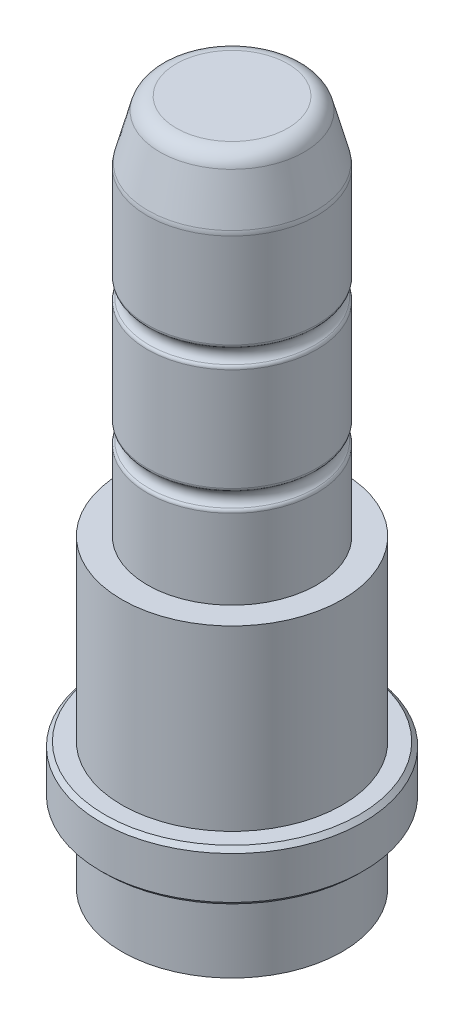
ISO-10303-21;
HEADER;
FILE_DESCRIPTION(('STEP AP214'),'2;1');
FILE_NAME('part.step','',(''),(''),'','','');
FILE_SCHEMA(('AUTOMOTIVE_DESIGN { 1 0 10303 214 1 1 1 1 }'));
ENDSEC;
DATA;
#1=APPLICATION_CONTEXT('core data for automotive mechanical design processes');
#2=APPLICATION_PROTOCOL_DEFINITION('international standard','automotive_design',2000,#1);
#3=PRODUCT_CONTEXT('',#1,'mechanical');
#4=PRODUCT('Part','Part','',(#3));
#5=PRODUCT_RELATED_PRODUCT_CATEGORY('part','',(#4));
#6=PRODUCT_DEFINITION_FORMATION('','',#4);
#7=PRODUCT_DEFINITION_CONTEXT('part definition',#1,'design');
#8=PRODUCT_DEFINITION('design','',#6,#7);
#9=PRODUCT_DEFINITION_SHAPE('','',#8);
#10=(LENGTH_UNIT() NAMED_UNIT(*) SI_UNIT(.MILLI.,.METRE.));
#11=(NAMED_UNIT(*) PLANE_ANGLE_UNIT() SI_UNIT($,.RADIAN.));
#12=(NAMED_UNIT(*) SI_UNIT($,.STERADIAN.) SOLID_ANGLE_UNIT());
#13=UNCERTAINTY_MEASURE_WITH_UNIT(LENGTH_MEASURE(1.E-05),#10,'distance_accuracy_value','');
#14=(GEOMETRIC_REPRESENTATION_CONTEXT(3) GLOBAL_UNCERTAINTY_ASSIGNED_CONTEXT((#13)) GLOBAL_UNIT_ASSIGNED_CONTEXT((#10,
#11,#12)) REPRESENTATION_CONTEXT('',''));
#15=CARTESIAN_POINT('',(0.,0.,0.));
#16=DIRECTION('',(0.,0.,1.));
#17=DIRECTION('',(1.,0.,0.));
#18=AXIS2_PLACEMENT_3D('',#15,#16,#17);
#19=CARTESIAN_POINT('',(0.,6.,0.));
#20=DIRECTION('',(0.,-1.,0.));
#21=DIRECTION('',(0.,0.,-1.));
#22=AXIS2_PLACEMENT_3D('',#19,#20,#21);
#23=CYLINDRICAL_SURFACE('',#22,15.5);
#24=CARTESIAN_POINT('',(0.,5.5,0.));
#25=DIRECTION('',(0.,1.,0.));
#26=DIRECTION('',(0.,0.,1.));
#27=AXIS2_PLACEMENT_3D('',#24,#25,#26);
#28=CIRCLE('',#27,15.5);
#29=CARTESIAN_POINT('',(0.,5.5,15.5));
#30=VERTEX_POINT('',#29);
#31=EDGE_CURVE('E22',#30,#30,#28,.F.);
#32=ORIENTED_EDGE('',*,*,#31,.T.);
#33=EDGE_LOOP('',(#32));
#34=FACE_BOUND('',#33,.T.);
#35=CARTESIAN_POINT('',(0.,0.5,0.));
#36=DIRECTION('',(0.,1.,0.));
#37=DIRECTION('',(0.,0.,1.));
#38=AXIS2_PLACEMENT_3D('',#35,#36,#37);
#39=CIRCLE('',#38,15.5);
#40=CARTESIAN_POINT('',(0.,0.5,15.5));
#41=VERTEX_POINT('',#40);
#42=EDGE_CURVE('E30',#41,#41,#39,.T.);
#43=ORIENTED_EDGE('',*,*,#42,.T.);
#44=EDGE_LOOP('',(#43));
#45=FACE_BOUND('',#44,.T.);
#46=ADVANCED_FACE('F14',(#34,#45),#23,.T.);
#47=CARTESIAN_POINT('',(0.,6.,0.));
#48=DIRECTION('',(0.,1.,0.));
#49=DIRECTION('',(0.,0.,1.));
#50=AXIS2_PLACEMENT_3D('',#47,#48,#49);
#51=PLANE('',#50);
#52=CARTESIAN_POINT('',(0.,6.,0.));
#53=DIRECTION('',(0.,1.,0.));
#54=DIRECTION('',(0.,0.,1.));
#55=AXIS2_PLACEMENT_3D('',#52,#53,#54);
#56=CIRCLE('',#55,15.);
#57=CARTESIAN_POINT('',(0.,6.,15.));
#58=VERTEX_POINT('',#57);
#59=EDGE_CURVE('E37',#58,#58,#56,.T.);
#60=ORIENTED_EDGE('',*,*,#59,.T.);
#61=EDGE_LOOP('',(#60));
#62=FACE_BOUND('',#61,.T.);
#63=CARTESIAN_POINT('',(0.,6.,0.));
#64=DIRECTION('',(0.,-1.,0.));
#65=DIRECTION('',(0.,0.,-1.));
#66=AXIS2_PLACEMENT_3D('',#63,#64,#65);
#67=CIRCLE('',#66,13.);
#68=CARTESIAN_POINT('',(0.,6.,-13.));
#69=VERTEX_POINT('',#68);
#70=EDGE_CURVE('E48',#69,#69,#67,.T.);
#71=ORIENTED_EDGE('',*,*,#70,.T.);
#72=EDGE_LOOP('',(#71));
#73=FACE_BOUND('',#72,.T.);
#74=ADVANCED_FACE('F125',(#62,#73),#51,.T.);
#75=CARTESIAN_POINT('',(0.,0.,0.));
#76=DIRECTION('',(0.,1.,0.));
#77=DIRECTION('',(0.,0.,1.));
#78=AXIS2_PLACEMENT_3D('',#75,#76,#77);
#79=PLANE('',#78);
#80=CARTESIAN_POINT('',(0.,0.,0.));
#81=DIRECTION('',(0.,1.,0.));
#82=DIRECTION('',(0.,0.,1.));
#83=AXIS2_PLACEMENT_3D('',#80,#81,#82);
#84=CIRCLE('',#83,15.);
#85=CARTESIAN_POINT('',(0.,0.,15.));
#86=VERTEX_POINT('',#85);
#87=EDGE_CURVE('E9',#86,#86,#84,.F.);
#88=ORIENTED_EDGE('',*,*,#87,.T.);
#89=EDGE_LOOP('',(#88));
#90=FACE_BOUND('',#89,.T.);
#91=CARTESIAN_POINT('',(0.,0.,0.));
#92=DIRECTION('',(0.,1.,0.));
#93=DIRECTION('',(0.,0.,1.));
#94=AXIS2_PLACEMENT_3D('',#91,#92,#93);
#95=CIRCLE('',#94,13.);
#96=CARTESIAN_POINT('',(0.,0.,13.));
#97=VERTEX_POINT('',#96);
#98=EDGE_CURVE('E104',#97,#97,#95,.T.);
#99=ORIENTED_EDGE('',*,*,#98,.T.);
#100=EDGE_LOOP('',(#99));
#101=FACE_BOUND('',#100,.T.);
#102=ADVANCED_FACE('F108',(#90,#101),#79,.F.);
#103=CARTESIAN_POINT('',(0.,27.,0.));
#104=DIRECTION('',(0.,-1.,0.));
#105=DIRECTION('',(0.,0.,-1.));
#106=AXIS2_PLACEMENT_3D('',#103,#104,#105);
#107=PLANE('',#106);
#108=CARTESIAN_POINT('',(0.,27.,0.));
#109=DIRECTION('',(0.,1.,0.));
#110=DIRECTION('',(0.,0.,1.));
#111=AXIS2_PLACEMENT_3D('',#108,#109,#110);
#112=CIRCLE('',#111,10.);
#113=CARTESIAN_POINT('',(0.,27.,9.99999999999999));
#114=VERTEX_POINT('',#113);
#115=EDGE_CURVE('E43',#114,#114,#112,.T.);
#116=ORIENTED_EDGE('',*,*,#115,.F.);
#117=EDGE_LOOP('',(#116));
#118=FACE_BOUND('',#117,.T.);
#119=CARTESIAN_POINT('',(0.,27.,0.));
#120=DIRECTION('',(0.,-1.,0.));
#121=DIRECTION('',(0.,0.,-1.));
#122=AXIS2_PLACEMENT_3D('',#119,#120,#121);
#123=CIRCLE('',#122,13.);
#124=CARTESIAN_POINT('',(0.,27.,-13.));
#125=VERTEX_POINT('',#124);
#126=EDGE_CURVE('E44',#125,#125,#123,.T.);
#127=ORIENTED_EDGE('',*,*,#126,.F.);
#128=EDGE_LOOP('',(#127));
#129=FACE_BOUND('',#128,.T.);
#130=ADVANCED_FACE('F134',(#118,#129),#107,.F.);
#131=CARTESIAN_POINT('',(0.,6.,0.));
#132=DIRECTION('',(0.,-1.,0.));
#133=DIRECTION('',(0.,0.,-1.));
#134=AXIS2_PLACEMENT_3D('',#131,#132,#133);
#135=CYLINDRICAL_SURFACE('',#134,13.);
#136=ORIENTED_EDGE('',*,*,#70,.F.);
#137=EDGE_LOOP('',(#136));
#138=FACE_BOUND('',#137,.T.);
#139=ORIENTED_EDGE('',*,*,#126,.T.);
#140=EDGE_LOOP('',(#139));
#141=FACE_BOUND('',#140,.T.);
#142=ADVANCED_FACE('F138',(#138,#141),#135,.T.);
#143=CARTESIAN_POINT('',(0.,72.,0.));
#144=DIRECTION('',(0.,1.,0.));
#145=DIRECTION('',(0.,0.,1.));
#146=AXIS2_PLACEMENT_3D('',#143,#144,#145);
#147=PLANE('',#146);
#148=CARTESIAN_POINT('',(0.,72.,0.));
#149=DIRECTION('',(0.,1.,0.));
#150=DIRECTION('',(0.,0.,1.));
#151=AXIS2_PLACEMENT_3D('',#148,#149,#150);
#152=CIRCLE('',#151,6.5897016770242);
#153=CARTESIAN_POINT('',(0.,72.,6.5897016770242));
#154=VERTEX_POINT('',#153);
#155=EDGE_CURVE('E52',#154,#154,#152,.T.);
#156=ORIENTED_EDGE('',*,*,#155,.T.);
#157=EDGE_LOOP('',(#156));
#158=FACE_BOUND('',#157,.T.);
#159=ADVANCED_FACE('F142',(#158),#147,.T.);
#160=CARTESIAN_POINT('',(0.,70.,0.));
#161=DIRECTION('',(0.,1.,0.));
#162=DIRECTION('',(0.,0.,1.));
#163=AXIS2_PLACEMENT_3D('',#160,#161,#162);
#164=TOROIDAL_SURFACE('',#163,6.5897016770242,2.);
#165=CARTESIAN_POINT('',(0.,70.5176380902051,0.));
#166=DIRECTION('',(0.,1.,0.));
#167=DIRECTION('',(0.,0.,1.));
#168=AXIS2_PLACEMENT_3D('',#165,#166,#167);
#169=CIRCLE('',#168,8.52155332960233);
#170=CARTESIAN_POINT('',(0.,70.5176380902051,8.52155332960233));
#171=VERTEX_POINT('',#170);
#172=EDGE_CURVE('E56',#171,#171,#169,.T.);
#173=ORIENTED_EDGE('',*,*,#172,.T.);
#174=EDGE_LOOP('',(#173));
#175=FACE_BOUND('',#174,.T.);
#176=ORIENTED_EDGE('',*,*,#155,.F.);
#177=EDGE_LOOP('',(#176));
#178=FACE_BOUND('',#177,.T.);
#179=ADVANCED_FACE('F146',(#175,#178),#164,.T.);
#180=CARTESIAN_POINT('',(0.,70.5176380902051,0.));
#181=DIRECTION('',(0.,-1.,0.));
#182=DIRECTION('',(0.,0.,-1.));
#183=AXIS2_PLACEMENT_3D('',#180,#181,#182);
#184=CONICAL_SURFACE('',#183,8.52155332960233,0.261799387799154);
#185=CARTESIAN_POINT('',(0.,65.2543330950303,0.));
#186=DIRECTION('',(0.,1.,0.));
#187=DIRECTION('',(0.,0.,1.));
#188=AXIS2_PLACEMENT_3D('',#185,#186,#187);
#189=CIRCLE('',#188,9.93185165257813);
#190=CARTESIAN_POINT('',(0.,65.2543330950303,9.93185165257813));
#191=VERTEX_POINT('',#190);
#192=EDGE_CURVE('E60',#191,#191,#189,.T.);
#193=ORIENTED_EDGE('',*,*,#192,.T.);
#194=EDGE_LOOP('',(#193));
#195=FACE_BOUND('',#194,.T.);
#196=ORIENTED_EDGE('',*,*,#172,.F.);
#197=EDGE_LOOP('',(#196));
#198=FACE_BOUND('',#197,.T.);
#199=ADVANCED_FACE('F150',(#195,#198),#184,.T.);
#200=CARTESIAN_POINT('',(0.,64.7366950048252,0.));
#201=DIRECTION('',(0.,1.,0.));
#202=DIRECTION('',(0.,0.,1.));
#203=AXIS2_PLACEMENT_3D('',#200,#201,#202);
#204=TOROIDAL_SURFACE('',#203,8.,2.);
#205=CARTESIAN_POINT('',(0.,64.7366950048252,0.));
#206=DIRECTION('',(0.,1.,0.));
#207=DIRECTION('',(0.,0.,1.));
#208=AXIS2_PLACEMENT_3D('',#205,#206,#207);
#209=CIRCLE('',#208,10.);
#210=CARTESIAN_POINT('',(0.,64.7366950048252,10.));
#211=VERTEX_POINT('',#210);
#212=EDGE_CURVE('E64',#211,#211,#209,.T.);
#213=ORIENTED_EDGE('',*,*,#212,.T.);
#214=EDGE_LOOP('',(#213));
#215=FACE_BOUND('',#214,.T.);
#216=ORIENTED_EDGE('',*,*,#192,.F.);
#217=EDGE_LOOP('',(#216));
#218=FACE_BOUND('',#217,.T.);
#219=ADVANCED_FACE('F154',(#215,#218),#204,.T.);
#220=CARTESIAN_POINT('',(0.,72.,0.));
#221=DIRECTION('',(0.,1.,0.));
#222=DIRECTION('',(0.,0.,1.));
#223=AXIS2_PLACEMENT_3D('',#220,#221,#222);
#224=CYLINDRICAL_SURFACE('',#223,10.);
#225=CARTESIAN_POINT('',(0.,53.6053529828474,0.));
#226=DIRECTION('',(0.,1.,0.));
#227=DIRECTION('',(0.,0.,1.));
#228=AXIS2_PLACEMENT_3D('',#225,#226,#227);
#229=CIRCLE('',#228,10.);
#230=CARTESIAN_POINT('',(0.,53.6053529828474,9.99999999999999));
#231=VERTEX_POINT('',#230);
#232=EDGE_CURVE('E68',#231,#231,#229,.T.);
#233=ORIENTED_EDGE('',*,*,#232,.T.);
#234=EDGE_LOOP('',(#233));
#235=FACE_BOUND('',#234,.T.);
#236=ORIENTED_EDGE('',*,*,#212,.F.);
#237=EDGE_LOOP('',(#236));
#238=FACE_BOUND('',#237,.T.);
#239=ADVANCED_FACE('F158',(#235,#238),#224,.T.);
#240=CARTESIAN_POINT('',(0.,53.6053529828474,0.));
#241=DIRECTION('',(0.,1.,0.));
#242=DIRECTION('',(0.,0.,1.));
#243=AXIS2_PLACEMENT_3D('',#240,#241,#242);
#244=TOROIDAL_SURFACE('',#243,9.5,0.5);
#245=CARTESIAN_POINT('',(0.,53.2122772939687,0.));
#246=DIRECTION('',(0.,1.,0.));
#247=DIRECTION('',(0.,0.,1.));
#248=AXIS2_PLACEMENT_3D('',#245,#246,#247);
#249=CIRCLE('',#248,9.80901699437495);
#250=CARTESIAN_POINT('',(0.,53.2122772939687,9.80901699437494));
#251=VERTEX_POINT('',#250);
#252=EDGE_CURVE('E72',#251,#251,#249,.T.);
#253=ORIENTED_EDGE('',*,*,#252,.T.);
#254=EDGE_LOOP('',(#253));
#255=FACE_BOUND('',#254,.T.);
#256=ORIENTED_EDGE('',*,*,#232,.F.);
#257=EDGE_LOOP('',(#256));
#258=FACE_BOUND('',#257,.T.);
#259=ADVANCED_FACE('F162',(#255,#258),#244,.T.);
#260=CARTESIAN_POINT('',(0.,52.3333333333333,0.));
#261=DIRECTION('',(0.,1.,0.));
#262=DIRECTION('',(0.,0.,1.));
#263=AXIS2_PLACEMENT_3D('',#260,#261,#262);
#264=TOROIDAL_SURFACE('',#263,10.5,1.11803398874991);
#265=CARTESIAN_POINT('',(0.,51.454389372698,0.));
#266=DIRECTION('',(0.,1.,0.));
#267=DIRECTION('',(0.,0.,1.));
#268=AXIS2_PLACEMENT_3D('',#265,#266,#267);
#269=CIRCLE('',#268,9.80901699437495);
#270=CARTESIAN_POINT('',(0.,51.454389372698,9.80901699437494));
#271=VERTEX_POINT('',#270);
#272=EDGE_CURVE('E76',#271,#271,#269,.T.);
#273=ORIENTED_EDGE('',*,*,#272,.T.);
#274=EDGE_LOOP('',(#273));
#275=FACE_BOUND('',#274,.T.);
#276=ORIENTED_EDGE('',*,*,#252,.F.);
#277=EDGE_LOOP('',(#276));
#278=FACE_BOUND('',#277,.T.);
#279=ADVANCED_FACE('F166',(#275,#278),#264,.F.);
#280=CARTESIAN_POINT('',(0.,51.0613136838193,0.));
#281=DIRECTION('',(0.,1.,0.));
#282=DIRECTION('',(0.,0.,1.));
#283=AXIS2_PLACEMENT_3D('',#280,#281,#282);
#284=TOROIDAL_SURFACE('',#283,9.5,0.5);
#285=CARTESIAN_POINT('',(0.,51.0613136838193,0.));
#286=DIRECTION('',(0.,1.,0.));
#287=DIRECTION('',(0.,0.,1.));
#288=AXIS2_PLACEMENT_3D('',#285,#286,#287);
#289=CIRCLE('',#288,10.);
#290=CARTESIAN_POINT('',(0.,51.0613136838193,9.99999999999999));
#291=VERTEX_POINT('',#290);
#292=EDGE_CURVE('E80',#291,#291,#289,.T.);
#293=ORIENTED_EDGE('',*,*,#292,.T.);
#294=EDGE_LOOP('',(#293));
#295=FACE_BOUND('',#294,.T.);
#296=ORIENTED_EDGE('',*,*,#272,.F.);
#297=EDGE_LOOP('',(#296));
#298=FACE_BOUND('',#297,.T.);
#299=ADVANCED_FACE('F170',(#295,#298),#284,.T.);
#300=CARTESIAN_POINT('',(0.,72.,0.));
#301=DIRECTION('',(0.,1.,0.));
#302=DIRECTION('',(0.,0.,1.));
#303=AXIS2_PLACEMENT_3D('',#300,#301,#302);
#304=CYLINDRICAL_SURFACE('',#303,10.);
#305=CARTESIAN_POINT('',(0.,38.9386863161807,0.));
#306=DIRECTION('',(0.,1.,0.));
#307=DIRECTION('',(0.,0.,1.));
#308=AXIS2_PLACEMENT_3D('',#305,#306,#307);
#309=CIRCLE('',#308,10.);
#310=CARTESIAN_POINT('',(0.,38.9386863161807,9.99999999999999));
#311=VERTEX_POINT('',#310);
#312=EDGE_CURVE('E84',#311,#311,#309,.T.);
#313=ORIENTED_EDGE('',*,*,#312,.T.);
#314=EDGE_LOOP('',(#313));
#315=FACE_BOUND('',#314,.T.);
#316=ORIENTED_EDGE('',*,*,#292,.F.);
#317=EDGE_LOOP('',(#316));
#318=FACE_BOUND('',#317,.T.);
#319=ADVANCED_FACE('F174',(#315,#318),#304,.T.);
#320=CARTESIAN_POINT('',(0.,38.9386863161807,0.));
#321=DIRECTION('',(0.,1.,0.));
#322=DIRECTION('',(0.,0.,1.));
#323=AXIS2_PLACEMENT_3D('',#320,#321,#322);
#324=TOROIDAL_SURFACE('',#323,9.5,0.5);
#325=CARTESIAN_POINT('',(0.,38.545610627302,0.));
#326=DIRECTION('',(0.,1.,0.));
#327=DIRECTION('',(0.,0.,1.));
#328=AXIS2_PLACEMENT_3D('',#325,#326,#327);
#329=CIRCLE('',#328,9.80901699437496);
#330=CARTESIAN_POINT('',(0.,38.545610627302,9.80901699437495));
#331=VERTEX_POINT('',#330);
#332=EDGE_CURVE('E88',#331,#331,#329,.T.);
#333=ORIENTED_EDGE('',*,*,#332,.T.);
#334=EDGE_LOOP('',(#333));
#335=FACE_BOUND('',#334,.T.);
#336=ORIENTED_EDGE('',*,*,#312,.F.);
#337=EDGE_LOOP('',(#336));
#338=FACE_BOUND('',#337,.T.);
#339=ADVANCED_FACE('F178',(#335,#338),#324,.T.);
#340=CARTESIAN_POINT('',(0.,37.6666666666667,0.));
#341=DIRECTION('',(0.,1.,0.));
#342=DIRECTION('',(0.,0.,1.));
#343=AXIS2_PLACEMENT_3D('',#340,#341,#342);
#344=TOROIDAL_SURFACE('',#343,10.5,1.11803398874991);
#345=CARTESIAN_POINT('',(0.,36.7877227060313,0.));
#346=DIRECTION('',(0.,1.,0.));
#347=DIRECTION('',(0.,0.,1.));
#348=AXIS2_PLACEMENT_3D('',#345,#346,#347);
#349=CIRCLE('',#348,9.80901699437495);
#350=CARTESIAN_POINT('',(0.,36.7877227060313,9.80901699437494));
#351=VERTEX_POINT('',#350);
#352=EDGE_CURVE('E91',#351,#351,#349,.T.);
#353=ORIENTED_EDGE('',*,*,#352,.T.);
#354=EDGE_LOOP('',(#353));
#355=FACE_BOUND('',#354,.T.);
#356=ORIENTED_EDGE('',*,*,#332,.F.);
#357=EDGE_LOOP('',(#356));
#358=FACE_BOUND('',#357,.T.);
#359=ADVANCED_FACE('F182',(#355,#358),#344,.F.);
#360=CARTESIAN_POINT('',(0.,36.3946470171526,0.));
#361=DIRECTION('',(0.,1.,0.));
#362=DIRECTION('',(0.,0.,1.));
#363=AXIS2_PLACEMENT_3D('',#360,#361,#362);
#364=TOROIDAL_SURFACE('',#363,9.5,0.5);
#365=CARTESIAN_POINT('',(0.,36.3946470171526,0.));
#366=DIRECTION('',(0.,1.,0.));
#367=DIRECTION('',(0.,0.,1.));
#368=AXIS2_PLACEMENT_3D('',#365,#366,#367);
#369=CIRCLE('',#368,10.);
#370=CARTESIAN_POINT('',(0.,36.3946470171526,9.99999999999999));
#371=VERTEX_POINT('',#370);
#372=EDGE_CURVE('E95',#371,#371,#369,.T.);
#373=ORIENTED_EDGE('',*,*,#372,.T.);
#374=EDGE_LOOP('',(#373));
#375=FACE_BOUND('',#374,.T.);
#376=ORIENTED_EDGE('',*,*,#352,.F.);
#377=EDGE_LOOP('',(#376));
#378=FACE_BOUND('',#377,.T.);
#379=ADVANCED_FACE('F186',(#375,#378),#364,.T.);
#380=CARTESIAN_POINT('',(0.,72.,0.));
#381=DIRECTION('',(0.,1.,0.));
#382=DIRECTION('',(0.,0.,1.));
#383=AXIS2_PLACEMENT_3D('',#380,#381,#382);
#384=CYLINDRICAL_SURFACE('',#383,10.);
#385=ORIENTED_EDGE('',*,*,#115,.T.);
#386=EDGE_LOOP('',(#385));
#387=FACE_BOUND('',#386,.T.);
#388=ORIENTED_EDGE('',*,*,#372,.F.);
#389=EDGE_LOOP('',(#388));
#390=FACE_BOUND('',#389,.T.);
#391=ADVANCED_FACE('F121',(#387,#390),#384,.T.);
#392=CARTESIAN_POINT('',(0.,-9.,0.));
#393=DIRECTION('',(0.,-1.,0.));
#394=DIRECTION('',(0.,0.,-1.));
#395=AXIS2_PLACEMENT_3D('',#392,#393,#394);
#396=PLANE('',#395);
#397=CARTESIAN_POINT('',(0.,-9.,0.));
#398=DIRECTION('',(0.,1.,0.));
#399=DIRECTION('',(0.,0.,1.));
#400=AXIS2_PLACEMENT_3D('',#397,#398,#399);
#401=CIRCLE('',#400,13.);
#402=CARTESIAN_POINT('',(0.,-9.,13.));
#403=VERTEX_POINT('',#402);
#404=EDGE_CURVE('E98',#403,#403,#401,.T.);
#405=ORIENTED_EDGE('',*,*,#404,.F.);
#406=EDGE_LOOP('',(#405));
#407=FACE_BOUND('',#406,.T.);
#408=ADVANCED_FACE('F113',(#407),#396,.T.);
#409=CARTESIAN_POINT('',(0.,0.,0.));
#410=DIRECTION('',(0.,1.,0.));
#411=DIRECTION('',(0.,0.,1.));
#412=AXIS2_PLACEMENT_3D('',#409,#410,#411);
#413=CYLINDRICAL_SURFACE('',#412,13.);
#414=ORIENTED_EDGE('',*,*,#404,.T.);
#415=EDGE_LOOP('',(#414));
#416=FACE_BOUND('',#415,.T.);
#417=ORIENTED_EDGE('',*,*,#98,.F.);
#418=EDGE_LOOP('',(#417));
#419=FACE_BOUND('',#418,.T.);
#420=ADVANCED_FACE('F110',(#416,#419),#413,.T.);
#421=CARTESIAN_POINT('',(0.,6.,0.));
#422=DIRECTION('',(0.,-1.,0.));
#423=DIRECTION('',(0.,0.,-1.));
#424=AXIS2_PLACEMENT_3D('',#421,#422,#423);
#425=CONICAL_SURFACE('',#424,15.,0.78539816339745);
#426=ORIENTED_EDGE('',*,*,#31,.F.);
#427=EDGE_LOOP('',(#426));
#428=FACE_BOUND('',#427,.T.);
#429=ORIENTED_EDGE('',*,*,#59,.F.);
#430=EDGE_LOOP('',(#429));
#431=FACE_BOUND('',#430,.T.);
#432=ADVANCED_FACE('F112',(#428,#431),#425,.T.);
#433=CARTESIAN_POINT('',(0.,0.5,0.));
#434=DIRECTION('',(0.,1.,0.));
#435=DIRECTION('',(0.,0.,1.));
#436=AXIS2_PLACEMENT_3D('',#433,#434,#435);
#437=CONICAL_SURFACE('',#436,15.5,0.785398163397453);
#438=ORIENTED_EDGE('',*,*,#87,.F.);
#439=EDGE_LOOP('',(#438));
#440=FACE_BOUND('',#439,.T.);
#441=ORIENTED_EDGE('',*,*,#42,.F.);
#442=EDGE_LOOP('',(#441));
#443=FACE_BOUND('',#442,.T.);
#444=ADVANCED_FACE('F16',(#440,#443),#437,.T.);
#445=CLOSED_SHELL('',(#46,#74,#102,#130,#142,#159,#179,#199,#219,#239,#259,#279,#299,#319,#339,
#359,#379,#391,#408,#420,#432,#444));
#446=MANIFOLD_SOLID_BREP('B1',#445);
#447=ADVANCED_BREP_SHAPE_REPRESENTATION('',(#18,#446),#14);
#448=SHAPE_DEFINITION_REPRESENTATION(#9,#447);
ENDSEC;
END-ISO-10303-21;
